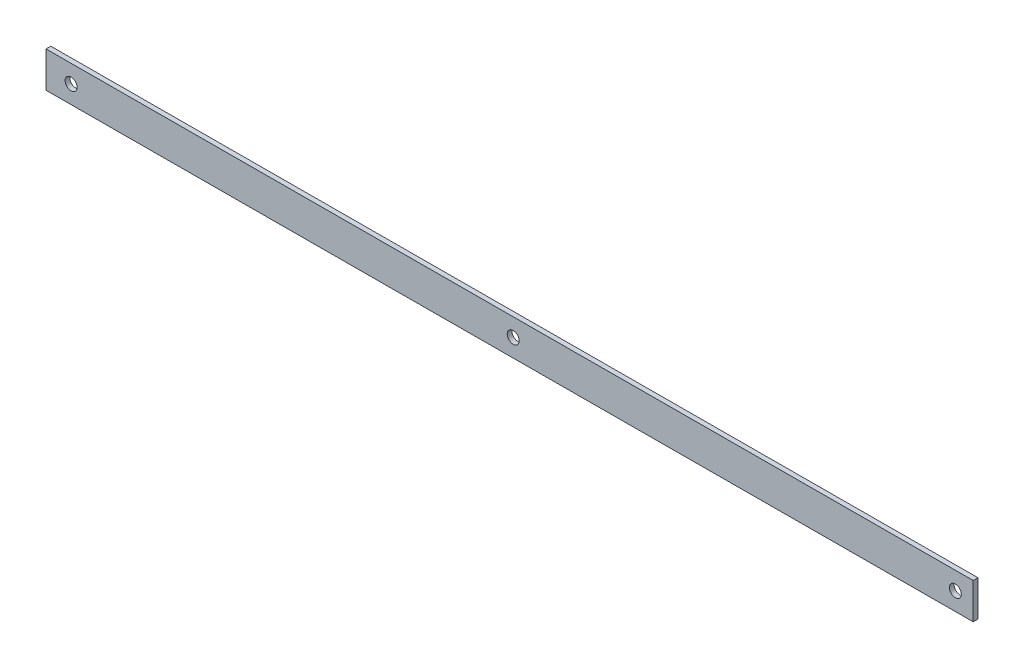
ISO-10303-21;
HEADER;
FILE_DESCRIPTION(('STEP AP214'),'2;1');
FILE_NAME('part.step','',(''),(''),'','','');
FILE_SCHEMA(('AUTOMOTIVE_DESIGN { 1 0 10303 214 1 1 1 1 }'));
ENDSEC;
DATA;
#1=APPLICATION_CONTEXT('core data for automotive mechanical design processes');
#2=APPLICATION_PROTOCOL_DEFINITION('international standard','automotive_design',2000,#1);
#3=PRODUCT_CONTEXT('',#1,'mechanical');
#4=PRODUCT('Part','Part','',(#3));
#5=PRODUCT_RELATED_PRODUCT_CATEGORY('part','',(#4));
#6=PRODUCT_DEFINITION_FORMATION('','',#4);
#7=PRODUCT_DEFINITION_CONTEXT('part definition',#1,'design');
#8=PRODUCT_DEFINITION('design','',#6,#7);
#9=PRODUCT_DEFINITION_SHAPE('','',#8);
#10=(LENGTH_UNIT() NAMED_UNIT(*) SI_UNIT(.MILLI.,.METRE.));
#11=(NAMED_UNIT(*) PLANE_ANGLE_UNIT() SI_UNIT($,.RADIAN.));
#12=(NAMED_UNIT(*) SI_UNIT($,.STERADIAN.) SOLID_ANGLE_UNIT());
#13=UNCERTAINTY_MEASURE_WITH_UNIT(LENGTH_MEASURE(1.E-05),#10,'distance_accuracy_value','');
#14=(GEOMETRIC_REPRESENTATION_CONTEXT(3) GLOBAL_UNCERTAINTY_ASSIGNED_CONTEXT((#13)) GLOBAL_UNIT_ASSIGNED_CONTEXT((#10,
#11,#12)) REPRESENTATION_CONTEXT('',''));
#15=CARTESIAN_POINT('',(0.,0.,0.));
#16=DIRECTION('',(0.,0.,1.));
#17=DIRECTION('',(1.,0.,0.));
#18=AXIS2_PLACEMENT_3D('',#15,#16,#17);
#19=CARTESIAN_POINT('',(-485.079367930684,-4.75244247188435,4.));
#20=DIRECTION('',(0.,0.,1.));
#21=DIRECTION('',(1.,0.,0.));
#22=AXIS2_PLACEMENT_3D('',#19,#20,#21);
#23=PLANE('',#22);
#24=CARTESIAN_POINT('',(-93.5818923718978,-18.3727921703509,4.));
#25=DIRECTION('',(0.,0.,1.));
#26=DIRECTION('',(1.,0.,0.));
#27=AXIS2_PLACEMENT_3D('',#24,#25,#26);
#28=CIRCLE('',#27,5.);
#29=CARTESIAN_POINT('',(-88.5818923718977,-18.3727921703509,4.));
#30=VERTEX_POINT('',#29);
#31=EDGE_CURVE('E121',#30,#30,#28,.T.);
#32=ORIENTED_EDGE('',*,*,#31,.F.);
#33=EDGE_LOOP('',(#32));
#34=FACE_BOUND('',#33,.T.);
#35=DIRECTION('',(0.,-1.,0.));
#36=VECTOR('',#35,1.);
#37=CARTESIAN_POINT('',(-485.079367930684,-4.75244247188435,4.));
#38=LINE('',#37,#36);
#39=CARTESIAN_POINT('',(-485.079367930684,-4.75244247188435,4.));
#40=VERTEX_POINT('',#39);
#41=CARTESIAN_POINT('',(-485.079367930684,-34.752628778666,4.));
#42=VERTEX_POINT('',#41);
#43=EDGE_CURVE('E95',#40,#42,#38,.T.);
#44=ORIENTED_EDGE('',*,*,#43,.T.);
#45=DIRECTION('',(0.999993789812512,0.00352424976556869,0.));
#46=VECTOR('',#45,1.);
#47=CARTESIAN_POINT('',(-485.079367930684,-34.752628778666,4.));
#48=LINE('',#47,#46);
#49=CARTESIAN_POINT('',(291.915806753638,-32.0142867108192,4.));
#50=VERTEX_POINT('',#49);
#51=EDGE_CURVE('E80',#42,#50,#48,.T.);
#52=ORIENTED_EDGE('',*,*,#51,.T.);
#53=DIRECTION('',(0.,1.,0.));
#54=VECTOR('',#53,1.);
#55=CARTESIAN_POINT('',(291.915806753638,-2.01410040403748,4.));
#56=LINE('',#55,#54);
#57=CARTESIAN_POINT('',(291.915806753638,-2.01410040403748,4.));
#58=VERTEX_POINT('',#57);
#59=EDGE_CURVE('E46',#50,#58,#56,.T.);
#60=ORIENTED_EDGE('',*,*,#59,.T.);
#61=DIRECTION('',(-0.999993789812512,-0.00352424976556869,0.));
#62=VECTOR('',#61,1.);
#63=CARTESIAN_POINT('',(-485.079367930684,-4.75244247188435,4.));
#64=LINE('',#63,#62);
#65=EDGE_CURVE('E41',#58,#40,#64,.T.);
#66=ORIENTED_EDGE('',*,*,#65,.T.);
#67=EDGE_LOOP('',(#44,#52,#60,#66));
#68=FACE_BOUND('',#67,.T.);
#69=CARTESIAN_POINT('',(-464.079591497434,-19.678526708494,4.));
#70=DIRECTION('',(0.,0.,1.));
#71=DIRECTION('',(1.,0.,0.));
#72=AXIS2_PLACEMENT_3D('',#69,#70,#71);
#73=CIRCLE('',#72,4.99999999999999);
#74=CARTESIAN_POINT('',(-459.079591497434,-19.678526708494,4.));
#75=VERTEX_POINT('',#74);
#76=EDGE_CURVE('E85',#75,#75,#73,.T.);
#77=ORIENTED_EDGE('',*,*,#76,.F.);
#78=EDGE_LOOP('',(#77));
#79=FACE_BOUND('',#78,.T.);
#80=CARTESIAN_POINT('',(276.915806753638,-17.0670576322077,4.));
#81=DIRECTION('',(0.,0.,1.));
#82=DIRECTION('',(1.,0.,0.));
#83=AXIS2_PLACEMENT_3D('',#80,#81,#82);
#84=CIRCLE('',#83,4.99999999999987);
#85=CARTESIAN_POINT('',(281.915806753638,-17.0670576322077,4.));
#86=VERTEX_POINT('',#85);
#87=EDGE_CURVE('E115',#86,#86,#84,.T.);
#88=ORIENTED_EDGE('',*,*,#87,.F.);
#89=EDGE_LOOP('',(#88));
#90=FACE_BOUND('',#89,.T.);
#91=ADVANCED_FACE('F26',(#34,#68,#79,#90),#23,.T.);
#92=CARTESIAN_POINT('',(-485.079367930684,-4.75244247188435,0.));
#93=DIRECTION('',(0.,0.,1.));
#94=DIRECTION('',(1.,0.,0.));
#95=AXIS2_PLACEMENT_3D('',#92,#93,#94);
#96=PLANE('',#95);
#97=CARTESIAN_POINT('',(-93.5818923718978,-18.3727921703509,0.));
#98=DIRECTION('',(0.,0.,1.));
#99=DIRECTION('',(1.,0.,0.));
#100=AXIS2_PLACEMENT_3D('',#97,#98,#99);
#101=CIRCLE('',#100,5.);
#102=CARTESIAN_POINT('',(-88.5818923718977,-18.3727921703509,0.));
#103=VERTEX_POINT('',#102);
#104=EDGE_CURVE('E117',#103,#103,#101,.T.);
#105=ORIENTED_EDGE('',*,*,#104,.T.);
#106=EDGE_LOOP('',(#105));
#107=FACE_BOUND('',#106,.T.);
#108=DIRECTION('',(0.,-1.,0.));
#109=VECTOR('',#108,1.);
#110=CARTESIAN_POINT('',(-485.079367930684,-4.75244247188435,0.));
#111=LINE('',#110,#109);
#112=CARTESIAN_POINT('',(-485.079367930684,-4.75244247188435,0.));
#113=VERTEX_POINT('',#112);
#114=CARTESIAN_POINT('',(-485.079367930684,-34.752628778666,0.));
#115=VERTEX_POINT('',#114);
#116=EDGE_CURVE('E72',#113,#115,#111,.T.);
#117=ORIENTED_EDGE('',*,*,#116,.F.);
#118=DIRECTION('',(-0.999993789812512,-0.00352424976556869,0.));
#119=VECTOR('',#118,1.);
#120=CARTESIAN_POINT('',(-485.079367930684,-4.75244247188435,0.));
#121=LINE('',#120,#119);
#122=CARTESIAN_POINT('',(291.915806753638,-2.01410040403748,0.));
#123=VERTEX_POINT('',#122);
#124=EDGE_CURVE('E93',#123,#113,#121,.T.);
#125=ORIENTED_EDGE('',*,*,#124,.F.);
#126=DIRECTION('',(0.,1.,0.));
#127=VECTOR('',#126,1.);
#128=CARTESIAN_POINT('',(291.915806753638,-2.01410040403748,0.));
#129=LINE('',#128,#127);
#130=CARTESIAN_POINT('',(291.915806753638,-32.0142867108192,0.));
#131=VERTEX_POINT('',#130);
#132=EDGE_CURVE('E73',#131,#123,#129,.T.);
#133=ORIENTED_EDGE('',*,*,#132,.F.);
#134=DIRECTION('',(0.999993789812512,0.00352424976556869,0.));
#135=VECTOR('',#134,1.);
#136=CARTESIAN_POINT('',(-485.079367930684,-34.752628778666,0.));
#137=LINE('',#136,#135);
#138=EDGE_CURVE('E67',#115,#131,#137,.T.);
#139=ORIENTED_EDGE('',*,*,#138,.F.);
#140=EDGE_LOOP('',(#117,#125,#133,#139));
#141=FACE_BOUND('',#140,.T.);
#142=CARTESIAN_POINT('',(-464.079591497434,-19.678526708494,0.));
#143=DIRECTION('',(0.,0.,1.));
#144=DIRECTION('',(1.,0.,0.));
#145=AXIS2_PLACEMENT_3D('',#142,#143,#144);
#146=CIRCLE('',#145,4.99999999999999);
#147=CARTESIAN_POINT('',(-459.079591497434,-19.678526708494,0.));
#148=VERTEX_POINT('',#147);
#149=EDGE_CURVE('E88',#148,#148,#146,.T.);
#150=ORIENTED_EDGE('',*,*,#149,.T.);
#151=EDGE_LOOP('',(#150));
#152=FACE_BOUND('',#151,.T.);
#153=CARTESIAN_POINT('',(276.915806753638,-17.0670576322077,0.));
#154=DIRECTION('',(0.,0.,1.));
#155=DIRECTION('',(1.,0.,0.));
#156=AXIS2_PLACEMENT_3D('',#153,#154,#155);
#157=CIRCLE('',#156,4.99999999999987);
#158=CARTESIAN_POINT('',(281.915806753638,-17.0670576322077,0.));
#159=VERTEX_POINT('',#158);
#160=EDGE_CURVE('E118',#159,#159,#157,.T.);
#161=ORIENTED_EDGE('',*,*,#160,.T.);
#162=EDGE_LOOP('',(#161));
#163=FACE_BOUND('',#162,.T.);
#164=ADVANCED_FACE('F68',(#107,#141,#152,#163),#96,.F.);
#165=CARTESIAN_POINT('',(-485.079367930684,-4.75244247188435,4.));
#166=DIRECTION('',(1.,0.,0.));
#167=DIRECTION('',(0.,0.,-1.));
#168=AXIS2_PLACEMENT_3D('',#165,#166,#167);
#169=PLANE('',#168);
#170=ORIENTED_EDGE('',*,*,#116,.T.);
#171=DIRECTION('',(0.,0.,-1.));
#172=VECTOR('',#171,1.);
#173=CARTESIAN_POINT('',(-485.079367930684,-34.752628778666,4.));
#174=LINE('',#173,#172);
#175=EDGE_CURVE('E11',#42,#115,#174,.T.);
#176=ORIENTED_EDGE('',*,*,#175,.F.);
#177=ORIENTED_EDGE('',*,*,#43,.F.);
#178=DIRECTION('',(0.,0.,-1.));
#179=VECTOR('',#178,1.);
#180=CARTESIAN_POINT('',(-485.079367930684,-4.75244247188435,4.));
#181=LINE('',#180,#179);
#182=EDGE_CURVE('E84',#40,#113,#181,.T.);
#183=ORIENTED_EDGE('',*,*,#182,.T.);
#184=EDGE_LOOP('',(#170,#176,#177,#183));
#185=FACE_BOUND('',#184,.T.);
#186=ADVANCED_FACE('F28',(#185),#169,.F.);
#187=CARTESIAN_POINT('',(-485.079367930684,-34.752628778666,4.));
#188=DIRECTION('',(-0.00352424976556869,0.999993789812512,0.));
#189=DIRECTION('',(-0.999993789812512,-0.00352424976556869,0.));
#190=AXIS2_PLACEMENT_3D('',#187,#188,#189);
#191=PLANE('',#190);
#192=ORIENTED_EDGE('',*,*,#138,.T.);
#193=DIRECTION('',(0.,0.,-1.));
#194=VECTOR('',#193,1.);
#195=CARTESIAN_POINT('',(291.915806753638,-32.0142867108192,4.));
#196=LINE('',#195,#194);
#197=EDGE_CURVE('E34',#50,#131,#196,.T.);
#198=ORIENTED_EDGE('',*,*,#197,.F.);
#199=ORIENTED_EDGE('',*,*,#51,.F.);
#200=ORIENTED_EDGE('',*,*,#175,.T.);
#201=EDGE_LOOP('',(#192,#198,#199,#200));
#202=FACE_BOUND('',#201,.T.);
#203=ADVANCED_FACE('F79',(#202),#191,.F.);
#204=CARTESIAN_POINT('',(291.915806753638,-2.01410040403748,4.));
#205=DIRECTION('',(-1.,0.,0.));
#206=DIRECTION('',(0.,0.,1.));
#207=AXIS2_PLACEMENT_3D('',#204,#205,#206);
#208=PLANE('',#207);
#209=ORIENTED_EDGE('',*,*,#132,.T.);
#210=DIRECTION('',(0.,0.,-1.));
#211=VECTOR('',#210,1.);
#212=CARTESIAN_POINT('',(291.915806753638,-2.01410040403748,4.));
#213=LINE('',#212,#211);
#214=EDGE_CURVE('E101',#58,#123,#213,.T.);
#215=ORIENTED_EDGE('',*,*,#214,.F.);
#216=ORIENTED_EDGE('',*,*,#59,.F.);
#217=ORIENTED_EDGE('',*,*,#197,.T.);
#218=EDGE_LOOP('',(#209,#215,#216,#217));
#219=FACE_BOUND('',#218,.T.);
#220=ADVANCED_FACE('F104',(#219),#208,.F.);
#221=CARTESIAN_POINT('',(-485.079367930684,-4.75244247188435,4.));
#222=DIRECTION('',(0.00352424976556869,-0.999993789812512,0.));
#223=DIRECTION('',(0.999993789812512,0.00352424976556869,0.));
#224=AXIS2_PLACEMENT_3D('',#221,#222,#223);
#225=PLANE('',#224);
#226=ORIENTED_EDGE('',*,*,#124,.T.);
#227=ORIENTED_EDGE('',*,*,#182,.F.);
#228=ORIENTED_EDGE('',*,*,#65,.F.);
#229=ORIENTED_EDGE('',*,*,#214,.T.);
#230=EDGE_LOOP('',(#226,#227,#228,#229));
#231=FACE_BOUND('',#230,.T.);
#232=ADVANCED_FACE('F106',(#231),#225,.F.);
#233=CARTESIAN_POINT('',(-464.079591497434,-19.678526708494,4.));
#234=DIRECTION('',(0.,0.,-1.));
#235=DIRECTION('',(-1.,0.,0.));
#236=AXIS2_PLACEMENT_3D('',#233,#234,#235);
#237=CYLINDRICAL_SURFACE('',#236,4.99999999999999);
#238=ORIENTED_EDGE('',*,*,#76,.T.);
#239=EDGE_LOOP('',(#238));
#240=FACE_BOUND('',#239,.T.);
#241=ORIENTED_EDGE('',*,*,#149,.F.);
#242=EDGE_LOOP('',(#241));
#243=FACE_BOUND('',#242,.T.);
#244=ADVANCED_FACE('F131',(#240,#243),#237,.F.);
#245=CARTESIAN_POINT('',(-93.5818923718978,-18.3727921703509,4.));
#246=DIRECTION('',(0.,0.,-1.));
#247=DIRECTION('',(-1.,0.,0.));
#248=AXIS2_PLACEMENT_3D('',#245,#246,#247);
#249=CYLINDRICAL_SURFACE('',#248,5.);
#250=ORIENTED_EDGE('',*,*,#31,.T.);
#251=EDGE_LOOP('',(#250));
#252=FACE_BOUND('',#251,.T.);
#253=ORIENTED_EDGE('',*,*,#104,.F.);
#254=EDGE_LOOP('',(#253));
#255=FACE_BOUND('',#254,.T.);
#256=ADVANCED_FACE('F133',(#252,#255),#249,.F.);
#257=CARTESIAN_POINT('',(276.915806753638,-17.0670576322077,4.));
#258=DIRECTION('',(0.,0.,-1.));
#259=DIRECTION('',(-1.,0.,0.));
#260=AXIS2_PLACEMENT_3D('',#257,#258,#259);
#261=CYLINDRICAL_SURFACE('',#260,4.99999999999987);
#262=ORIENTED_EDGE('',*,*,#87,.T.);
#263=EDGE_LOOP('',(#262));
#264=FACE_BOUND('',#263,.T.);
#265=ORIENTED_EDGE('',*,*,#160,.F.);
#266=EDGE_LOOP('',(#265));
#267=FACE_BOUND('',#266,.T.);
#268=ADVANCED_FACE('F140',(#264,#267),#261,.F.);
#269=CLOSED_SHELL('',(#91,#164,#186,#203,#220,#232,#244,#256,#268));
#270=MANIFOLD_SOLID_BREP('B2',#269);
#271=ADVANCED_BREP_SHAPE_REPRESENTATION('',(#18,#270),#14);
#272=SHAPE_DEFINITION_REPRESENTATION(#9,#271);
ENDSEC;
END-ISO-10303-21;
